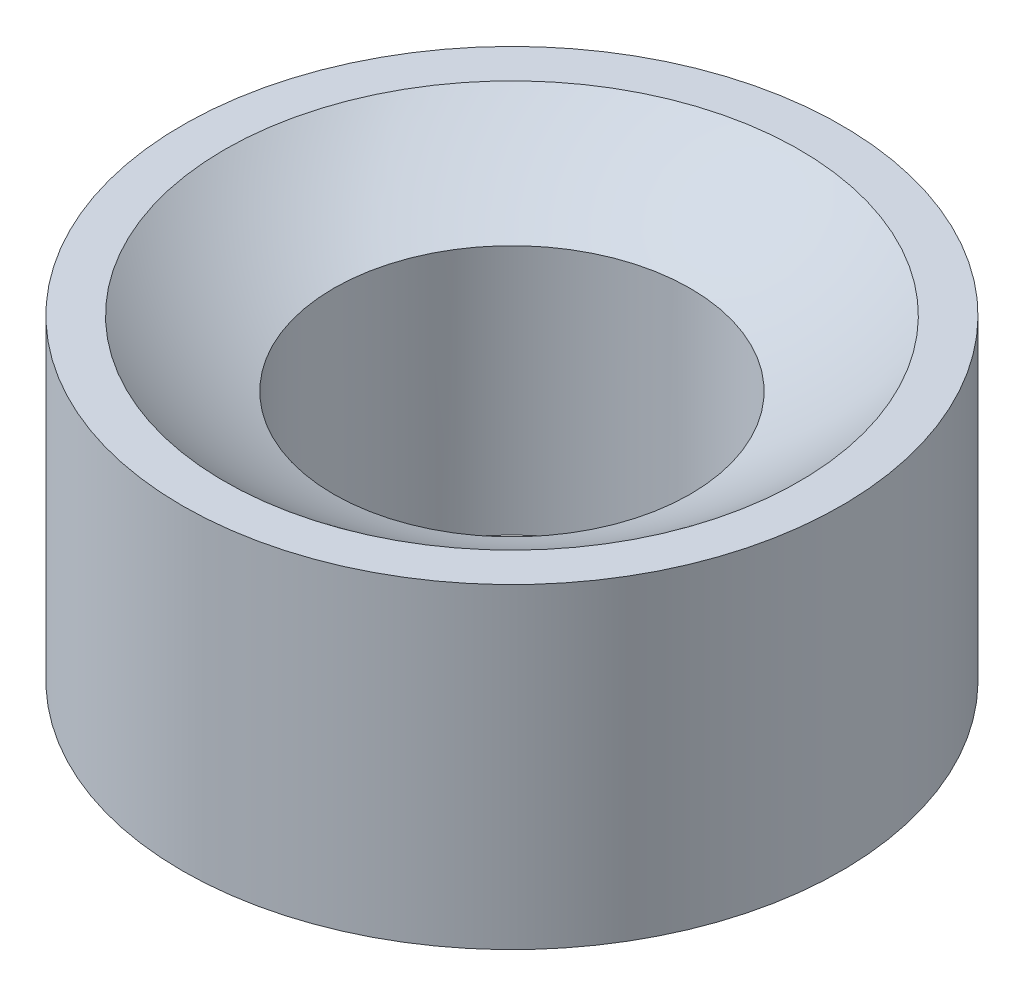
ISO-10303-21;
HEADER;
FILE_DESCRIPTION(('STEP AP214'),'2;1');
FILE_NAME('part.step','',(''),(''),'','','');
FILE_SCHEMA(('AUTOMOTIVE_DESIGN { 1 0 10303 214 1 1 1 1 }'));
ENDSEC;
DATA;
#1=APPLICATION_CONTEXT('core data for automotive mechanical design processes');
#2=APPLICATION_PROTOCOL_DEFINITION('international standard','automotive_design',2000,#1);
#3=PRODUCT_CONTEXT('',#1,'mechanical');
#4=PRODUCT('Part','Part','',(#3));
#5=PRODUCT_RELATED_PRODUCT_CATEGORY('part','',(#4));
#6=PRODUCT_DEFINITION_FORMATION('','',#4);
#7=PRODUCT_DEFINITION_CONTEXT('part definition',#1,'design');
#8=PRODUCT_DEFINITION('design','',#6,#7);
#9=PRODUCT_DEFINITION_SHAPE('','',#8);
#10=(LENGTH_UNIT() NAMED_UNIT(*) SI_UNIT(.MILLI.,.METRE.));
#11=(NAMED_UNIT(*) PLANE_ANGLE_UNIT() SI_UNIT($,.RADIAN.));
#12=(NAMED_UNIT(*) SI_UNIT($,.STERADIAN.) SOLID_ANGLE_UNIT());
#13=UNCERTAINTY_MEASURE_WITH_UNIT(LENGTH_MEASURE(1.E-05),#10,'distance_accuracy_value','');
#14=(GEOMETRIC_REPRESENTATION_CONTEXT(3) GLOBAL_UNCERTAINTY_ASSIGNED_CONTEXT((#13)) GLOBAL_UNIT_ASSIGNED_CONTEXT((#10,
#11,#12)) REPRESENTATION_CONTEXT('',''));
#15=CARTESIAN_POINT('',(0.,0.,0.));
#16=DIRECTION('',(0.,0.,1.));
#17=DIRECTION('',(1.,0.,0.));
#18=AXIS2_PLACEMENT_3D('',#15,#16,#17);
#19=CARTESIAN_POINT('',(474.940237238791,278.214667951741,0.));
#20=DIRECTION('',(0.,1.,0.));
#21=DIRECTION('',(-1.,0.,0.));
#22=AXIS2_PLACEMENT_3D('',#19,#20,#21);
#23=SPHERICAL_SURFACE('',#22,16.2707005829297);
#24=CARTESIAN_POINT('',(474.940237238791,265.57848191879,0.));
#25=DIRECTION('',(0.,1.,0.));
#26=DIRECTION('',(0.,0.,1.));
#27=AXIS2_PLACEMENT_3D('',#24,#25,#26);
#28=CIRCLE('',#27,10.25);
#29=CARTESIAN_POINT('',(464.690237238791,265.57848191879,0.));
#30=VERTEX_POINT('',#29);
#31=EDGE_CURVE('E49',#30,#30,#28,.T.);
#32=CARTESIAN_POINT('',(474.940237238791,263.23848360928,0.));
#33=DIRECTION('',(0.,1.,0.));
#34=DIRECTION('',(0.,0.,1.));
#35=AXIS2_PLACEMENT_3D('',#32,#33,#34);
#36=CIRCLE('',#35,6.35999999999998);
#37=CARTESIAN_POINT('',(468.580237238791,263.23848360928,0.));
#38=VERTEX_POINT('',#37);
#39=EDGE_CURVE('E10',#38,#38,#36,.T.);
#40=CARTESIAN_POINT('',(464.690237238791,265.57848191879,0.));
#41=CARTESIAN_POINT('',(464.727081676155,265.548595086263,0.));
#42=CARTESIAN_POINT('',(464.764056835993,265.518869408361,0.));
#43=CARTESIAN_POINT('',(464.838265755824,265.459742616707,0.));
#44=CARTESIAN_POINT('',(464.875499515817,265.430341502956,0.));
#45=CARTESIAN_POINT('',(464.950222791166,265.371866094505,0.));
#46=CARTESIAN_POINT('',(464.987712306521,265.342791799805,0.));
#47=CARTESIAN_POINT('',(465.06294422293,265.284972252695,0.));
#48=CARTESIAN_POINT('',(465.100686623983,265.256227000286,0.));
#49=CARTESIAN_POINT('',(465.176421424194,265.199067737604,0.));
#50=CARTESIAN_POINT('',(465.214413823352,265.170653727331,0.));
#51=CARTESIAN_POINT('',(465.290645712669,265.114159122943,0.));
#52=CARTESIAN_POINT('',(465.328885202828,265.086078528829,0.));
#53=CARTESIAN_POINT('',(465.405608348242,265.030252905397,0.));
#54=CARTESIAN_POINT('',(465.444092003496,265.00250787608,0.));
#55=CARTESIAN_POINT('',(465.521300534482,264.947355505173,0.));
#56=CARTESIAN_POINT('',(465.560025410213,264.919948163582,0.));
#57=CARTESIAN_POINT('',(465.637713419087,264.865473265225,0.));
#58=CARTESIAN_POINT('',(465.676676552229,264.838405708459,0.));
#59=CARTESIAN_POINT('',(465.754838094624,264.78461245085,0.));
#60=CARTESIAN_POINT('',(465.794036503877,264.757886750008,0.));
#61=CARTESIAN_POINT('',(465.872665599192,264.704779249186,0.));
#62=CARTESIAN_POINT('',(465.912096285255,264.678397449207,0.));
#63=CARTESIAN_POINT('',(465.991186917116,264.625979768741,0.));
#64=CARTESIAN_POINT('',(466.030846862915,264.599943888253,0.));
#65=CARTESIAN_POINT('',(466.110392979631,264.548220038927,0.));
#66=CARTESIAN_POINT('',(466.150279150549,264.522532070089,0.));
#67=CARTESIAN_POINT('',(466.230274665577,264.471506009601,0.));
#68=CARTESIAN_POINT('',(466.270384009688,264.44616791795,0.));
#69=CARTESIAN_POINT('',(466.350822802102,264.395843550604,0.));
#70=CARTESIAN_POINT('',(466.391152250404,264.370857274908,0.));
#71=CARTESIAN_POINT('',(466.472028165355,264.321238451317,0.));
#72=CARTESIAN_POINT('',(466.512574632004,264.296605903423,0.));
#73=CARTESIAN_POINT('',(466.5938814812,264.247696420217,0.));
#74=CARTESIAN_POINT('',(466.634641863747,264.223419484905,0.));
#75=CARTESIAN_POINT('',(466.716373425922,264.175223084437,0.));
#76=CARTESIAN_POINT('',(466.75734460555,264.15130361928,0.));
#77=CARTESIAN_POINT('',(466.839494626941,264.10382398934,0.));
#78=CARTESIAN_POINT('',(466.880673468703,264.080263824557,0.));
#79=CARTESIAN_POINT('',(466.963235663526,264.033504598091,0.));
#80=CARTESIAN_POINT('',(467.004619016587,264.010305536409,0.));
#81=CARTESIAN_POINT('',(467.087587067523,263.964270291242,0.));
#82=CARTESIAN_POINT('',(467.129171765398,263.941434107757,0.));
#83=CARTESIAN_POINT('',(467.212539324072,263.896126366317,0.));
#84=CARTESIAN_POINT('',(467.254322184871,263.873654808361,0.));
#85=CARTESIAN_POINT('',(467.33808287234,263.829078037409,0.));
#86=CARTESIAN_POINT('',(467.38006069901,263.806972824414,0.));
#87=CARTESIAN_POINT('',(467.464208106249,263.763130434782,0.));
#88=CARTESIAN_POINT('',(467.506377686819,263.741393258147,0.));
#89=CARTESIAN_POINT('',(467.590905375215,263.698288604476,0.));
#90=CARTESIAN_POINT('',(467.633263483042,263.676921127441,0.));
#91=CARTESIAN_POINT('',(467.718164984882,263.63455750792,0.));
#92=CARTESIAN_POINT('',(467.760708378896,263.613561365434,0.));
#93=CARTESIAN_POINT('',(467.84597719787,263.57194202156,0.));
#94=CARTESIAN_POINT('',(467.888702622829,263.551318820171,0.));
#95=CARTESIAN_POINT('',(467.974332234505,263.510446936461,0.));
#96=CARTESIAN_POINT('',(468.017236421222,263.49019825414,0.));
#97=CARTESIAN_POINT('',(468.103220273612,263.45007695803,0.));
#98=CARTESIAN_POINT('',(468.146299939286,263.430204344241,0.));
#99=CARTESIAN_POINT('',(468.232631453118,263.390836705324,0.));
#100=CARTESIAN_POINT('',(468.275883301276,263.371341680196,0.));
#101=CARTESIAN_POINT('',(468.362555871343,263.33273071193,0.));
#102=CARTESIAN_POINT('',(468.40597659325,263.313614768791,0.));
#103=CARTESIAN_POINT('',(468.492983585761,263.275763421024,0.));
#104=CARTESIAN_POINT('',(468.536569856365,263.257028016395,0.));
#105=CARTESIAN_POINT('',(468.580237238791,263.23848360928,0.));
#106=B_SPLINE_CURVE_WITH_KNOTS('',3,(#40,#41,#42,#43,#44,#45,#46,#47,#48,#49,#50,#51,#52,#53,
#54,#55,#56,#57,#58,#59,#60,#61,#62,#63,#64,#65,#66,#67,#68,#69,#70,#71,#72,#73,#74,#75,#76,#77,
#78,#79,#80,#81,#82,#83,#84,#85,#86,#87,#88,#89,#90,#91,#92,#93,#94,#95,#96,#97,#98,#99,#100,
#101,#102,#103,#104,#105),.UNSPECIFIED.,.F.,.F.,(4,2,2,2,2,2,2,2,2,2,2,2,2,2,2,2,2,2,2,2,2,2,2,
2,2,2,2,2,2,2,2,2,4),(0.,0.142325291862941,0.284650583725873,0.426975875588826,
0.569301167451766,0.711626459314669,0.853951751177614,0.996277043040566,1.1386023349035,
1.28092762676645,1.42325291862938,1.5655782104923,1.70790350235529,1.8502287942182,
1.99255408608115,2.13487937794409,2.27720466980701,2.41952996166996,2.56185525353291,
2.70418054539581,2.84650583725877,2.98883112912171,3.13115642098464,3.2734817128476,
3.41580700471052,3.55813229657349,3.7004575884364,3.84278288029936,3.98510817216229,
4.12743346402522,4.26975875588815,4.41208404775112,4.55440933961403),.UNSPECIFIED.);
#107=EDGE_CURVE('BSEAM30',#30,#38,#106,.T.);
#108=ORIENTED_EDGE('',*,*,#31,.T.);
#109=ORIENTED_EDGE('',*,*,#39,.F.);
#110=ORIENTED_EDGE('',*,*,#107,.T.);
#111=ORIENTED_EDGE('',*,*,#107,.F.);
#112=EDGE_LOOP('',(#108,#110,#109,#111));
#113=FACE_BOUND('',#112,.T.);
#114=ADVANCED_FACE('F30',(#113),#23,.F.);
#115=CARTESIAN_POINT('',(474.940237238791,265.57848191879,0.));
#116=DIRECTION('',(0.,1.,0.));
#117=DIRECTION('',(0.,0.,1.));
#118=AXIS2_PLACEMENT_3D('',#115,#116,#117);
#119=CYLINDRICAL_SURFACE('',#118,6.35999999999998);
#120=ORIENTED_EDGE('',*,*,#39,.T.);
#121=EDGE_LOOP('',(#120));
#122=FACE_BOUND('',#121,.T.);
#123=CARTESIAN_POINT('',(474.940237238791,254.303127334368,0.));
#124=DIRECTION('',(0.,1.,0.));
#125=DIRECTION('',(0.,0.,1.));
#126=AXIS2_PLACEMENT_3D('',#123,#124,#125);
#127=CIRCLE('',#126,6.35999999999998);
#128=CARTESIAN_POINT('',(474.940237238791,254.303127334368,6.35999999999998));
#129=VERTEX_POINT('',#128);
#130=EDGE_CURVE('E36',#129,#129,#127,.T.);
#131=ORIENTED_EDGE('',*,*,#130,.F.);
#132=EDGE_LOOP('',(#131));
#133=FACE_BOUND('',#132,.T.);
#134=ADVANCED_FACE('F67',(#122,#133),#119,.F.);
#135=CARTESIAN_POINT('',(463.18621194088,254.303127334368,0.));
#136=DIRECTION('',(0.,-1.,0.));
#137=DIRECTION('',(0.,0.,-1.));
#138=AXIS2_PLACEMENT_3D('',#135,#136,#137);
#139=PLANE('',#138);
#140=ORIENTED_EDGE('',*,*,#130,.T.);
#141=EDGE_LOOP('',(#140));
#142=FACE_BOUND('',#141,.T.);
#143=CARTESIAN_POINT('',(474.940237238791,254.303127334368,0.));
#144=DIRECTION('',(0.,1.,0.));
#145=DIRECTION('',(0.,0.,1.));
#146=AXIS2_PLACEMENT_3D('',#143,#144,#145);
#147=CIRCLE('',#146,11.7540252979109);
#148=CARTESIAN_POINT('',(474.940237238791,254.303127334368,11.7540252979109));
#149=VERTEX_POINT('',#148);
#150=EDGE_CURVE('E40',#149,#149,#147,.T.);
#151=ORIENTED_EDGE('',*,*,#150,.F.);
#152=EDGE_LOOP('',(#151));
#153=FACE_BOUND('',#152,.T.);
#154=ADVANCED_FACE('F63',(#142,#153),#139,.T.);
#155=CARTESIAN_POINT('',(474.940237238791,265.57848191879,0.));
#156=DIRECTION('',(0.,1.,0.));
#157=DIRECTION('',(0.,0.,1.));
#158=AXIS2_PLACEMENT_3D('',#155,#156,#157);
#159=CYLINDRICAL_SURFACE('',#158,11.7540252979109);
#160=ORIENTED_EDGE('',*,*,#150,.T.);
#161=EDGE_LOOP('',(#160));
#162=FACE_BOUND('',#161,.T.);
#163=CARTESIAN_POINT('',(474.940237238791,265.57848191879,0.));
#164=DIRECTION('',(0.,1.,0.));
#165=DIRECTION('',(0.,0.,1.));
#166=AXIS2_PLACEMENT_3D('',#163,#164,#165);
#167=CIRCLE('',#166,11.7540252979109);
#168=CARTESIAN_POINT('',(474.940237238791,265.57848191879,11.7540252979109));
#169=VERTEX_POINT('',#168);
#170=EDGE_CURVE('E44',#169,#169,#167,.T.);
#171=ORIENTED_EDGE('',*,*,#170,.F.);
#172=EDGE_LOOP('',(#171));
#173=FACE_BOUND('',#172,.T.);
#174=ADVANCED_FACE('F57',(#162,#173),#159,.T.);
#175=CARTESIAN_POINT('',(463.18621194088,265.57848191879,0.));
#176=DIRECTION('',(0.,1.,0.));
#177=DIRECTION('',(0.,0.,1.));
#178=AXIS2_PLACEMENT_3D('',#175,#176,#177);
#179=PLANE('',#178);
#180=ORIENTED_EDGE('',*,*,#170,.T.);
#181=EDGE_LOOP('',(#180));
#182=FACE_BOUND('',#181,.T.);
#183=ORIENTED_EDGE('',*,*,#31,.F.);
#184=EDGE_LOOP('',(#183));
#185=FACE_BOUND('',#184,.T.);
#186=ADVANCED_FACE('F55',(#182,#185),#179,.T.);
#187=CLOSED_SHELL('',(#114,#134,#154,#174,#186));
#188=MANIFOLD_SOLID_BREP('B2',#187);
#189=ADVANCED_BREP_SHAPE_REPRESENTATION('',(#18,#188),#14);
#190=SHAPE_DEFINITION_REPRESENTATION(#9,#189);
ENDSEC;
END-ISO-10303-21;
